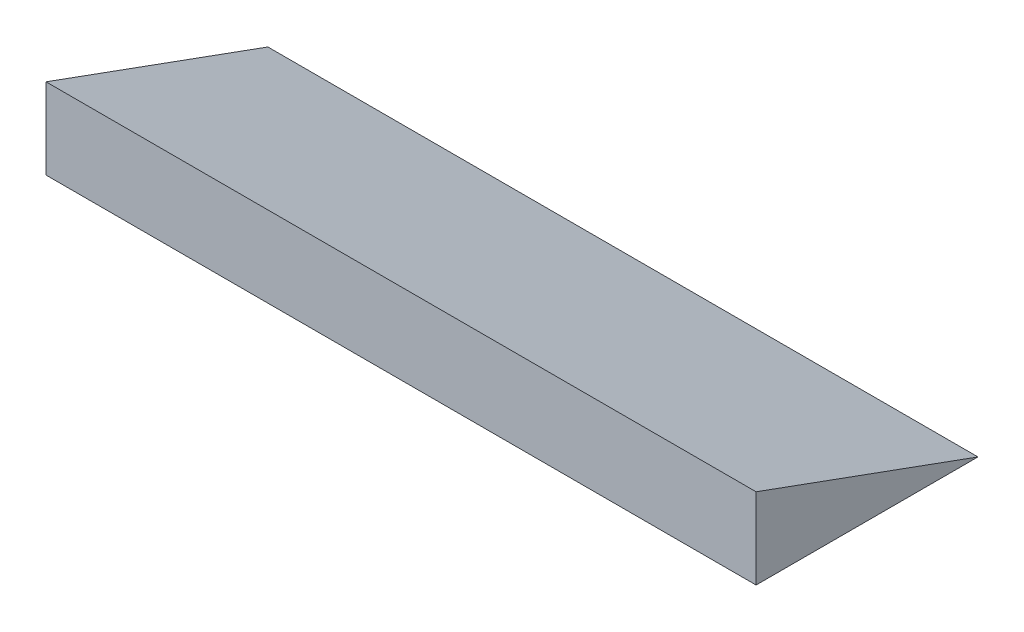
from build123d import *

# Parameters (mm, degrees)
BOSS_EXTRU_1_DEPTH      = 1600
ESQUISSE2_R             = 5
ENL_V_MAT_EXTRU_1_DEPTH = 10


with BuildPart() as part:
    # Esquisse1 → Boss.-Extru.1 (new body)
    with BuildSketch(Plane(origin=(0, 0, 0), x_dir=(0, 0, -1), z_dir=(1, 0, 0))):
        Polygon((0, 0), (500, 0), (0, 181.985117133), align=None)
    extrude(amount=BOSS_EXTRU_1_DEPTH)

    # Esquisse2 → Enl_v. mat.-Extru.1 (cut)
    with BuildSketch(Plane.XZ):
        with Locations(Location((550, -250, 0), (0, 0, 270))):
            Circle(ESQUISSE2_R)
        with Locations(Location((1050, -250, 0), (0, 0, 90))):
            Circle(ESQUISSE2_R)
    extrude(amount=-ENL_V_MAT_EXTRU_1_DEPTH, mode=Mode.SUBTRACT)


solid = part.part
